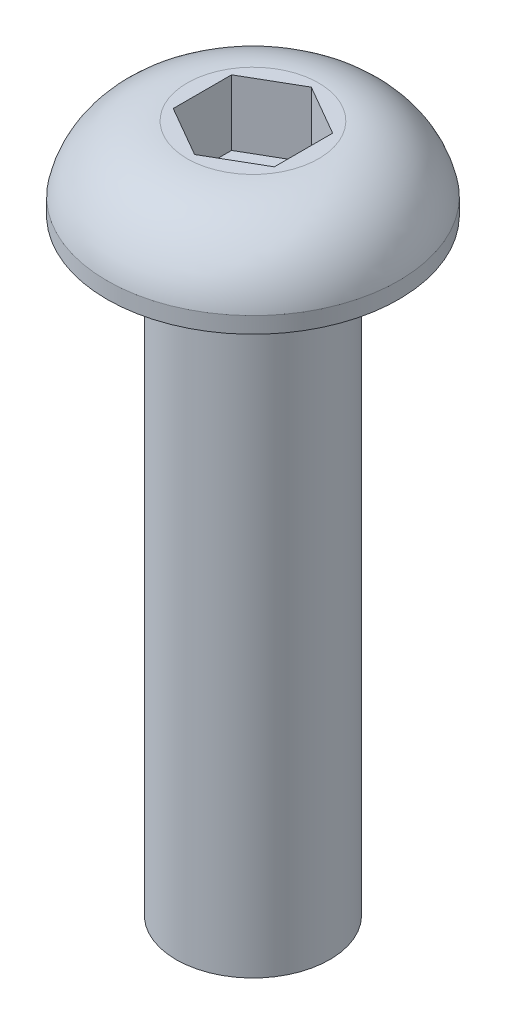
ISO-10303-21;
HEADER;
FILE_DESCRIPTION(('STEP AP214'),'2;1');
FILE_NAME('part.step','',(''),(''),'','','');
FILE_SCHEMA(('AUTOMOTIVE_DESIGN { 1 0 10303 214 1 1 1 1 }'));
ENDSEC;
DATA;
#1=APPLICATION_CONTEXT('core data for automotive mechanical design processes');
#2=APPLICATION_PROTOCOL_DEFINITION('international standard','automotive_design',2000,#1);
#3=PRODUCT_CONTEXT('',#1,'mechanical');
#4=PRODUCT('Part','Part','',(#3));
#5=PRODUCT_RELATED_PRODUCT_CATEGORY('part','',(#4));
#6=PRODUCT_DEFINITION_FORMATION('','',#4);
#7=PRODUCT_DEFINITION_CONTEXT('part definition',#1,'design');
#8=PRODUCT_DEFINITION('design','',#6,#7);
#9=PRODUCT_DEFINITION_SHAPE('','',#8);
#10=(LENGTH_UNIT() NAMED_UNIT(*) SI_UNIT(.MILLI.,.METRE.));
#11=(NAMED_UNIT(*) PLANE_ANGLE_UNIT() SI_UNIT($,.RADIAN.));
#12=(NAMED_UNIT(*) SI_UNIT($,.STERADIAN.) SOLID_ANGLE_UNIT());
#13=UNCERTAINTY_MEASURE_WITH_UNIT(LENGTH_MEASURE(1.E-05),#10,'distance_accuracy_value','');
#14=(GEOMETRIC_REPRESENTATION_CONTEXT(3) GLOBAL_UNCERTAINTY_ASSIGNED_CONTEXT((#13)) GLOBAL_UNIT_ASSIGNED_CONTEXT((#10,
#11,#12)) REPRESENTATION_CONTEXT('',''));
#15=CARTESIAN_POINT('',(0.,0.,0.));
#16=DIRECTION('',(0.,0.,1.));
#17=DIRECTION('',(1.,0.,0.));
#18=AXIS2_PLACEMENT_3D('',#15,#16,#17);
#19=CARTESIAN_POINT('',(0.,0.,0.));
#20=DIRECTION('',(0.,1.,0.));
#21=DIRECTION('',(0.,0.,1.));
#22=AXIS2_PLACEMENT_3D('',#19,#20,#21);
#23=PLANE('',#22);
#24=DIRECTION('',(0.,0.,1.));
#25=VECTOR('',#24,1.);
#26=CARTESIAN_POINT('',(-1.5875,0.,-0.91654355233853));
#27=LINE('',#26,#25);
#28=CARTESIAN_POINT('',(-1.5875,0.,-0.91654355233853));
#29=VERTEX_POINT('',#28);
#30=CARTESIAN_POINT('',(-1.5875,0.,0.91654355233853));
#31=VERTEX_POINT('',#30);
#32=EDGE_CURVE('E48',#29,#31,#27,.T.);
#33=ORIENTED_EDGE('',*,*,#32,.F.);
#34=DIRECTION('',(-0.866025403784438,0.,0.5));
#35=VECTOR('',#34,1.);
#36=CARTESIAN_POINT('',(0.,0.,-1.83308710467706));
#37=LINE('',#36,#35);
#38=CARTESIAN_POINT('',(0.,0.,-1.83308710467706));
#39=VERTEX_POINT('',#38);
#40=EDGE_CURVE('E132',#39,#29,#37,.T.);
#41=ORIENTED_EDGE('',*,*,#40,.F.);
#42=DIRECTION('',(0.866025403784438,0.,0.5));
#43=VECTOR('',#42,1.);
#44=CARTESIAN_POINT('',(0.,0.,-1.83308710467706));
#45=LINE('',#44,#43);
#46=CARTESIAN_POINT('',(1.5875,0.,-0.91654355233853));
#47=VERTEX_POINT('',#46);
#48=EDGE_CURVE('E130',#39,#47,#45,.T.);
#49=ORIENTED_EDGE('',*,*,#48,.T.);
#50=DIRECTION('',(0.,0.,1.));
#51=VECTOR('',#50,1.);
#52=CARTESIAN_POINT('',(1.5875,0.,-0.91654355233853));
#53=LINE('',#52,#51);
#54=CARTESIAN_POINT('',(1.5875,0.,0.916543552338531));
#55=VERTEX_POINT('',#54);
#56=EDGE_CURVE('E107',#47,#55,#53,.T.);
#57=ORIENTED_EDGE('',*,*,#56,.T.);
#58=DIRECTION('',(0.866025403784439,0.,-0.5));
#59=VECTOR('',#58,1.);
#60=CARTESIAN_POINT('',(0.,0.,1.83308710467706));
#61=LINE('',#60,#59);
#62=CARTESIAN_POINT('',(0.,0.,1.83308710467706));
#63=VERTEX_POINT('',#62);
#64=EDGE_CURVE('E126',#63,#55,#61,.T.);
#65=ORIENTED_EDGE('',*,*,#64,.F.);
#66=DIRECTION('',(-0.866025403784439,0.,-0.5));
#67=VECTOR('',#66,1.);
#68=CARTESIAN_POINT('',(0.,0.,1.83308710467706));
#69=LINE('',#68,#67);
#70=EDGE_CURVE('E123',#63,#31,#69,.T.);
#71=ORIENTED_EDGE('',*,*,#70,.T.);
#72=EDGE_LOOP('',(#33,#41,#49,#57,#65,#71));
#73=FACE_BOUND('',#72,.T.);
#74=CARTESIAN_POINT('',(0.,0.,0.));
#75=DIRECTION('',(0.,1.,0.));
#76=DIRECTION('',(0.,0.,1.));
#77=AXIS2_PLACEMENT_3D('',#74,#75,#76);
#78=CIRCLE('',#77,2.06375);
#79=CARTESIAN_POINT('',(0.,0.,2.06375));
#80=VERTEX_POINT('',#79);
#81=EDGE_CURVE('E11',#80,#80,#78,.T.);
#82=ORIENTED_EDGE('',*,*,#81,.T.);
#83=EDGE_LOOP('',(#82));
#84=FACE_BOUND('',#83,.T.);
#85=ADVANCED_FACE('F34',(#73,#84),#23,.T.);
#86=CARTESIAN_POINT('',(0.,-2.57317091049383,0.));
#87=DIRECTION('',(0.,1.,0.));
#88=DIRECTION('',(0.,0.,1.));
#89=AXIS2_PLACEMENT_3D('',#86,#87,#88);
#90=DEGENERATE_TOROIDAL_SURFACE('',#89,2.06375,2.57317091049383,.T.);
#91=CARTESIAN_POINT('',(0.,-2.0574,0.));
#92=DIRECTION('',(0.,1.,0.));
#93=DIRECTION('',(0.,0.,1.));
#94=AXIS2_PLACEMENT_3D('',#91,#92,#93);
#95=CIRCLE('',#94,4.5847);
#96=CARTESIAN_POINT('',(0.,-2.0574,4.5847));
#97=VERTEX_POINT('',#96);
#98=EDGE_CURVE('E41',#97,#97,#95,.T.);
#99=ORIENTED_EDGE('',*,*,#98,.T.);
#100=EDGE_LOOP('',(#99));
#101=FACE_BOUND('',#100,.T.);
#102=ORIENTED_EDGE('',*,*,#81,.F.);
#103=EDGE_LOOP('',(#102));
#104=FACE_BOUND('',#103,.T.);
#105=ADVANCED_FACE('F152',(#101,#104),#90,.T.);
#106=CARTESIAN_POINT('',(0.,25.4,0.));
#107=DIRECTION('',(0.,1.,0.));
#108=DIRECTION('',(0.,0.,1.));
#109=AXIS2_PLACEMENT_3D('',#106,#107,#108);
#110=CYLINDRICAL_SURFACE('',#109,4.5847);
#111=CARTESIAN_POINT('',(0.,-2.5654,0.));
#112=DIRECTION('',(0.,1.,0.));
#113=DIRECTION('',(0.,0.,1.));
#114=AXIS2_PLACEMENT_3D('',#111,#112,#113);
#115=CIRCLE('',#114,4.5847);
#116=CARTESIAN_POINT('',(0.,-2.5654,4.5847));
#117=VERTEX_POINT('',#116);
#118=EDGE_CURVE('E147',#117,#117,#115,.T.);
#119=ORIENTED_EDGE('',*,*,#118,.T.);
#120=EDGE_LOOP('',(#119));
#121=FACE_BOUND('',#120,.T.);
#122=ORIENTED_EDGE('',*,*,#98,.F.);
#123=EDGE_LOOP('',(#122));
#124=FACE_BOUND('',#123,.T.);
#125=ADVANCED_FACE('F155',(#121,#124),#110,.T.);
#126=CARTESIAN_POINT('',(2.413,-2.5654,0.));
#127=DIRECTION('',(0.,1.,0.));
#128=DIRECTION('',(0.,0.,1.));
#129=AXIS2_PLACEMENT_3D('',#126,#127,#128);
#130=PLANE('',#129);
#131=ORIENTED_EDGE('',*,*,#118,.F.);
#132=EDGE_LOOP('',(#131));
#133=FACE_BOUND('',#132,.T.);
#134=CARTESIAN_POINT('',(0.,-2.5654,0.));
#135=DIRECTION('',(0.,1.,0.));
#136=DIRECTION('',(0.,0.,1.));
#137=AXIS2_PLACEMENT_3D('',#134,#135,#136);
#138=CIRCLE('',#137,2.413);
#139=CARTESIAN_POINT('',(0.,-2.5654,2.413));
#140=VERTEX_POINT('',#139);
#141=EDGE_CURVE('E144',#140,#140,#138,.T.);
#142=ORIENTED_EDGE('',*,*,#141,.T.);
#143=EDGE_LOOP('',(#142));
#144=FACE_BOUND('',#143,.T.);
#145=ADVANCED_FACE('F157',(#133,#144),#130,.F.);
#146=CARTESIAN_POINT('',(0.,25.4,0.));
#147=DIRECTION('',(0.,1.,0.));
#148=DIRECTION('',(0.,0.,1.));
#149=AXIS2_PLACEMENT_3D('',#146,#147,#148);
#150=CYLINDRICAL_SURFACE('',#149,2.413);
#151=CARTESIAN_POINT('',(0.,-21.6154,0.));
#152=DIRECTION('',(0.,1.,0.));
#153=DIRECTION('',(0.,0.,1.));
#154=AXIS2_PLACEMENT_3D('',#151,#152,#153);
#155=CIRCLE('',#154,2.41300000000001);
#156=CARTESIAN_POINT('',(0.,-21.6154,2.41300000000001));
#157=VERTEX_POINT('',#156);
#158=EDGE_CURVE('E136',#157,#157,#155,.T.);
#159=ORIENTED_EDGE('',*,*,#158,.T.);
#160=EDGE_LOOP('',(#159));
#161=FACE_BOUND('',#160,.T.);
#162=ORIENTED_EDGE('',*,*,#141,.F.);
#163=EDGE_LOOP('',(#162));
#164=FACE_BOUND('',#163,.T.);
#165=ADVANCED_FACE('F164',(#161,#164),#150,.T.);
#166=CARTESIAN_POINT('',(2.41300000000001,-21.6154,0.));
#167=DIRECTION('',(0.,-1.,0.));
#168=DIRECTION('',(0.,0.,-1.));
#169=AXIS2_PLACEMENT_3D('',#166,#167,#168);
#170=PLANE('',#169);
#171=ORIENTED_EDGE('',*,*,#158,.F.);
#172=EDGE_LOOP('',(#171));
#173=FACE_BOUND('',#172,.T.);
#174=ADVANCED_FACE('F187',(#173),#170,.T.);
#175=CARTESIAN_POINT('',(-1.5875,-2.0574,-0.91654355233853));
#176=DIRECTION('',(-1.,0.,0.));
#177=DIRECTION('',(0.,0.,1.));
#178=AXIS2_PLACEMENT_3D('',#175,#176,#177);
#179=PLANE('',#178);
#180=ORIENTED_EDGE('',*,*,#32,.T.);
#181=DIRECTION('',(0.,1.,0.));
#182=VECTOR('',#181,1.);
#183=CARTESIAN_POINT('',(-1.5875,-2.0574,0.91654355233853));
#184=LINE('',#183,#182);
#185=CARTESIAN_POINT('',(-1.5875,-2.0574,0.91654355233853));
#186=VERTEX_POINT('',#185);
#187=EDGE_CURVE('E121',#186,#31,#184,.T.);
#188=ORIENTED_EDGE('',*,*,#187,.F.);
#189=DIRECTION('',(0.,0.,1.));
#190=VECTOR('',#189,1.);
#191=CARTESIAN_POINT('',(-1.5875,-2.0574,-0.91654355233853));
#192=LINE('',#191,#190);
#193=CARTESIAN_POINT('',(-1.5875,-2.0574,-0.91654355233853));
#194=VERTEX_POINT('',#193);
#195=EDGE_CURVE('E134',#194,#186,#192,.T.);
#196=ORIENTED_EDGE('',*,*,#195,.F.);
#197=DIRECTION('',(0.,1.,0.));
#198=VECTOR('',#197,1.);
#199=CARTESIAN_POINT('',(-1.5875,-2.0574,-0.91654355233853));
#200=LINE('',#199,#198);
#201=EDGE_CURVE('E56',#194,#29,#200,.T.);
#202=ORIENTED_EDGE('',*,*,#201,.T.);
#203=EDGE_LOOP('',(#180,#188,#196,#202));
#204=FACE_BOUND('',#203,.T.);
#205=ADVANCED_FACE('F177',(#204),#179,.F.);
#206=CARTESIAN_POINT('',(0.,-2.0574,-1.83308710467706));
#207=DIRECTION('',(-0.5,0.,-0.866025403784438));
#208=DIRECTION('',(-0.866025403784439,0.,0.5));
#209=AXIS2_PLACEMENT_3D('',#206,#207,#208);
#210=PLANE('',#209);
#211=ORIENTED_EDGE('',*,*,#40,.T.);
#212=ORIENTED_EDGE('',*,*,#201,.F.);
#213=DIRECTION('',(-0.866025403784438,0.,0.5));
#214=VECTOR('',#213,1.);
#215=CARTESIAN_POINT('',(0.,-2.0574,-1.83308710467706));
#216=LINE('',#215,#214);
#217=CARTESIAN_POINT('',(0.,-2.0574,-1.83308710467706));
#218=VERTEX_POINT('',#217);
#219=EDGE_CURVE('E100',#218,#194,#216,.T.);
#220=ORIENTED_EDGE('',*,*,#219,.F.);
#221=DIRECTION('',(0.,1.,0.));
#222=VECTOR('',#221,1.);
#223=CARTESIAN_POINT('',(0.,-2.0574,-1.83308710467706));
#224=LINE('',#223,#222);
#225=EDGE_CURVE('E96',#218,#39,#224,.T.);
#226=ORIENTED_EDGE('',*,*,#225,.T.);
#227=EDGE_LOOP('',(#211,#212,#220,#226));
#228=FACE_BOUND('',#227,.T.);
#229=ADVANCED_FACE('F179',(#228),#210,.F.);
#230=CARTESIAN_POINT('',(0.,-2.0574,-1.83308710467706));
#231=DIRECTION('',(-0.5,0.,0.866025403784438));
#232=DIRECTION('',(0.866025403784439,0.,0.5));
#233=AXIS2_PLACEMENT_3D('',#230,#231,#232);
#234=PLANE('',#233);
#235=ORIENTED_EDGE('',*,*,#48,.F.);
#236=ORIENTED_EDGE('',*,*,#225,.F.);
#237=DIRECTION('',(0.866025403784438,0.,0.5));
#238=VECTOR('',#237,1.);
#239=CARTESIAN_POINT('',(0.,-2.0574,-1.83308710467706));
#240=LINE('',#239,#238);
#241=CARTESIAN_POINT('',(1.5875,-2.0574,-0.91654355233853));
#242=VERTEX_POINT('',#241);
#243=EDGE_CURVE('E90',#218,#242,#240,.T.);
#244=ORIENTED_EDGE('',*,*,#243,.T.);
#245=DIRECTION('',(0.,1.,0.));
#246=VECTOR('',#245,1.);
#247=CARTESIAN_POINT('',(1.5875,-2.0574,-0.91654355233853));
#248=LINE('',#247,#246);
#249=EDGE_CURVE('E94',#242,#47,#248,.T.);
#250=ORIENTED_EDGE('',*,*,#249,.T.);
#251=EDGE_LOOP('',(#235,#236,#244,#250));
#252=FACE_BOUND('',#251,.T.);
#253=ADVANCED_FACE('F93',(#252),#234,.T.);
#254=CARTESIAN_POINT('',(1.5875,-2.0574,-0.91654355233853));
#255=DIRECTION('',(-1.,0.,0.));
#256=DIRECTION('',(0.,0.,1.));
#257=AXIS2_PLACEMENT_3D('',#254,#255,#256);
#258=PLANE('',#257);
#259=ORIENTED_EDGE('',*,*,#56,.F.);
#260=ORIENTED_EDGE('',*,*,#249,.F.);
#261=DIRECTION('',(0.,0.,1.));
#262=VECTOR('',#261,1.);
#263=CARTESIAN_POINT('',(1.5875,-2.0574,-0.91654355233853));
#264=LINE('',#263,#262);
#265=CARTESIAN_POINT('',(1.5875,-2.0574,0.916543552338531));
#266=VERTEX_POINT('',#265);
#267=EDGE_CURVE('E101',#242,#266,#264,.T.);
#268=ORIENTED_EDGE('',*,*,#267,.T.);
#269=DIRECTION('',(0.,1.,0.));
#270=VECTOR('',#269,1.);
#271=CARTESIAN_POINT('',(1.5875,-2.0574,0.916543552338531));
#272=LINE('',#271,#270);
#273=EDGE_CURVE('E109',#266,#55,#272,.T.);
#274=ORIENTED_EDGE('',*,*,#273,.T.);
#275=EDGE_LOOP('',(#259,#260,#268,#274));
#276=FACE_BOUND('',#275,.T.);
#277=ADVANCED_FACE('F104',(#276),#258,.T.);
#278=CARTESIAN_POINT('',(0.,-2.0574,1.83308710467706));
#279=DIRECTION('',(0.5,0.,0.866025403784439));
#280=DIRECTION('',(0.866025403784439,0.,-0.5));
#281=AXIS2_PLACEMENT_3D('',#278,#279,#280);
#282=PLANE('',#281);
#283=ORIENTED_EDGE('',*,*,#64,.T.);
#284=ORIENTED_EDGE('',*,*,#273,.F.);
#285=DIRECTION('',(0.866025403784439,0.,-0.5));
#286=VECTOR('',#285,1.);
#287=CARTESIAN_POINT('',(0.,-2.0574,1.83308710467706));
#288=LINE('',#287,#286);
#289=CARTESIAN_POINT('',(0.,-2.0574,1.83308710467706));
#290=VERTEX_POINT('',#289);
#291=EDGE_CURVE('E115',#290,#266,#288,.T.);
#292=ORIENTED_EDGE('',*,*,#291,.F.);
#293=DIRECTION('',(0.,1.,0.));
#294=VECTOR('',#293,1.);
#295=CARTESIAN_POINT('',(0.,-2.0574,1.83308710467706));
#296=LINE('',#295,#294);
#297=EDGE_CURVE('E139',#290,#63,#296,.T.);
#298=ORIENTED_EDGE('',*,*,#297,.T.);
#299=EDGE_LOOP('',(#283,#284,#292,#298));
#300=FACE_BOUND('',#299,.T.);
#301=ADVANCED_FACE('F193',(#300),#282,.F.);
#302=CARTESIAN_POINT('',(0.,-2.0574,1.83308710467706));
#303=DIRECTION('',(0.5,0.,-0.866025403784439));
#304=DIRECTION('',(-0.866025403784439,0.,-0.5));
#305=AXIS2_PLACEMENT_3D('',#302,#303,#304);
#306=PLANE('',#305);
#307=ORIENTED_EDGE('',*,*,#70,.F.);
#308=ORIENTED_EDGE('',*,*,#297,.F.);
#309=DIRECTION('',(-0.866025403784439,0.,-0.5));
#310=VECTOR('',#309,1.);
#311=CARTESIAN_POINT('',(0.,-2.0574,1.83308710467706));
#312=LINE('',#311,#310);
#313=EDGE_CURVE('E82',#290,#186,#312,.T.);
#314=ORIENTED_EDGE('',*,*,#313,.T.);
#315=ORIENTED_EDGE('',*,*,#187,.T.);
#316=EDGE_LOOP('',(#307,#308,#314,#315));
#317=FACE_BOUND('',#316,.T.);
#318=ADVANCED_FACE('F176',(#317),#306,.T.);
#319=CARTESIAN_POINT('',(-1.5875,-2.0574,2.74963065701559));
#320=DIRECTION('',(0.,1.,0.));
#321=DIRECTION('',(0.,0.,1.));
#322=AXIS2_PLACEMENT_3D('',#319,#320,#321);
#323=PLANE('',#322);
#324=ORIENTED_EDGE('',*,*,#195,.T.);
#325=ORIENTED_EDGE('',*,*,#313,.F.);
#326=ORIENTED_EDGE('',*,*,#291,.T.);
#327=ORIENTED_EDGE('',*,*,#267,.F.);
#328=ORIENTED_EDGE('',*,*,#243,.F.);
#329=ORIENTED_EDGE('',*,*,#219,.T.);
#330=EDGE_LOOP('',(#324,#325,#326,#327,#328,#329));
#331=FACE_BOUND('',#330,.T.);
#332=ADVANCED_FACE('F113',(#331),#323,.T.);
#333=CLOSED_SHELL('',(#85,#105,#125,#145,#165,#174,#205,#229,#253,#277,#301,#318,#332));
#334=MANIFOLD_SOLID_BREP('B2',#333);
#335=ADVANCED_BREP_SHAPE_REPRESENTATION('',(#18,#334),#14);
#336=SHAPE_DEFINITION_REPRESENTATION(#9,#335);
ENDSEC;
END-ISO-10303-21;
